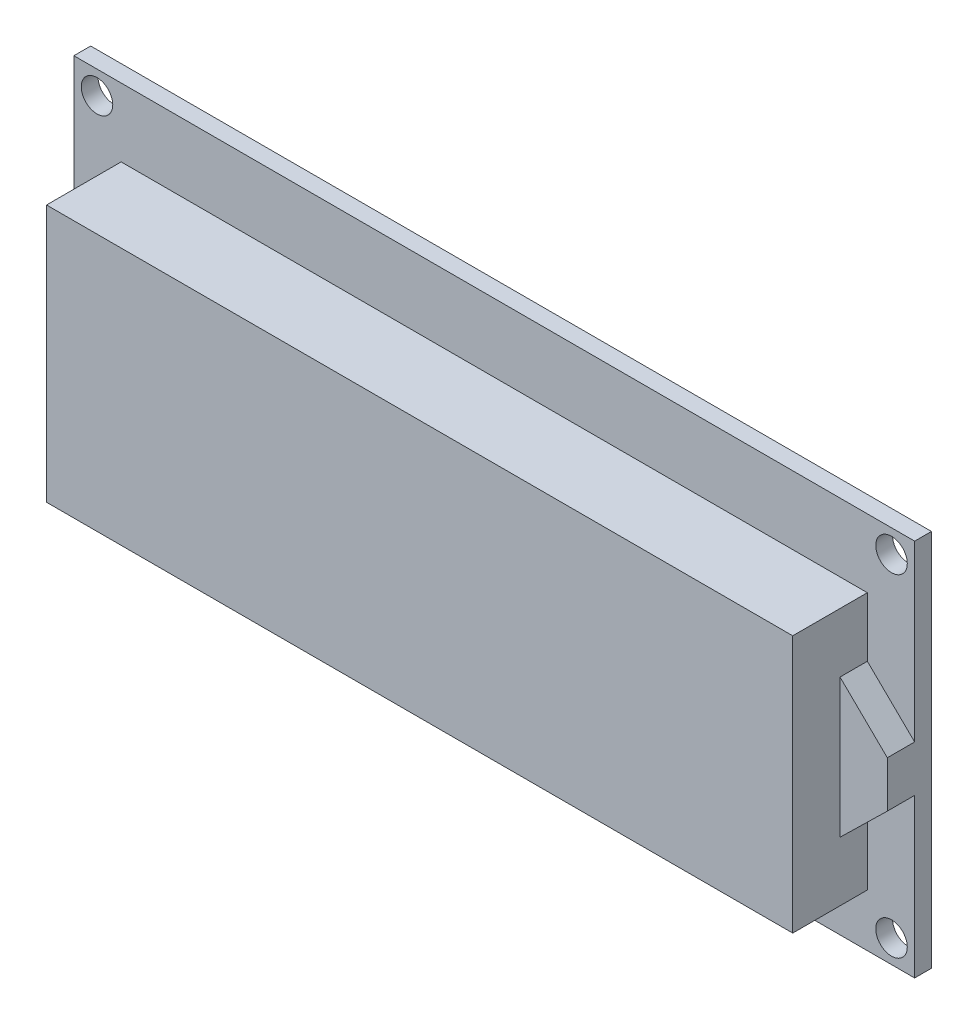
from build123d import *

# Parameters (mm, degrees)
SKETCH1_W           = 80
SKETCH1_H           = 36
SKETCH1_R           = 1.5
BOSS_EXTRUDE1_DEPTH = 1.6
SKETCH1_3_W         = 71
SKETCH1_3_H         = 24.5
BOSS_EXTRUDE2_DEPTH = 7.1
BOSS_EXTRUDE3_DEPTH = 2.6


with BuildPart() as part:
    # Sketch1 → Boss-Extrude1 (new body)
    with BuildSketch(Plane.XY):
        Rectangle(SKETCH1_W, SKETCH1_H)
        with Locations((-37.8, -15.8)):
            Circle(SKETCH1_R, mode=Mode.SUBTRACT)
        with Locations((-37.8, 15.8)):
            Circle(SKETCH1_R, mode=Mode.SUBTRACT)
        with Locations((37.8, 15.8)):
            Circle(SKETCH1_R, mode=Mode.SUBTRACT)
        with Locations((37.8, -15.8)):
            Circle(SKETCH1_R, mode=Mode.SUBTRACT)
    extrude(amount=-BOSS_EXTRUDE1_DEPTH)

    # Sketch1_3 → Boss-Extrude2 (add)
    with BuildSketch(Plane.XY):
        with Locations((0, -0.75)):
            Rectangle(SKETCH1_3_W, SKETCH1_3_H)
    extrude(amount=BOSS_EXTRUDE2_DEPTH)

    # Sketch2 → Boss-Extrude3 (add)
    with BuildSketch(Plane.XY):
        Polygon((40, -2.95), (40, 1.45), (35.5, 5.85), (35.5, -7.35), align=None)
    extrude(amount=BOSS_EXTRUDE3_DEPTH)


solid = part.part
